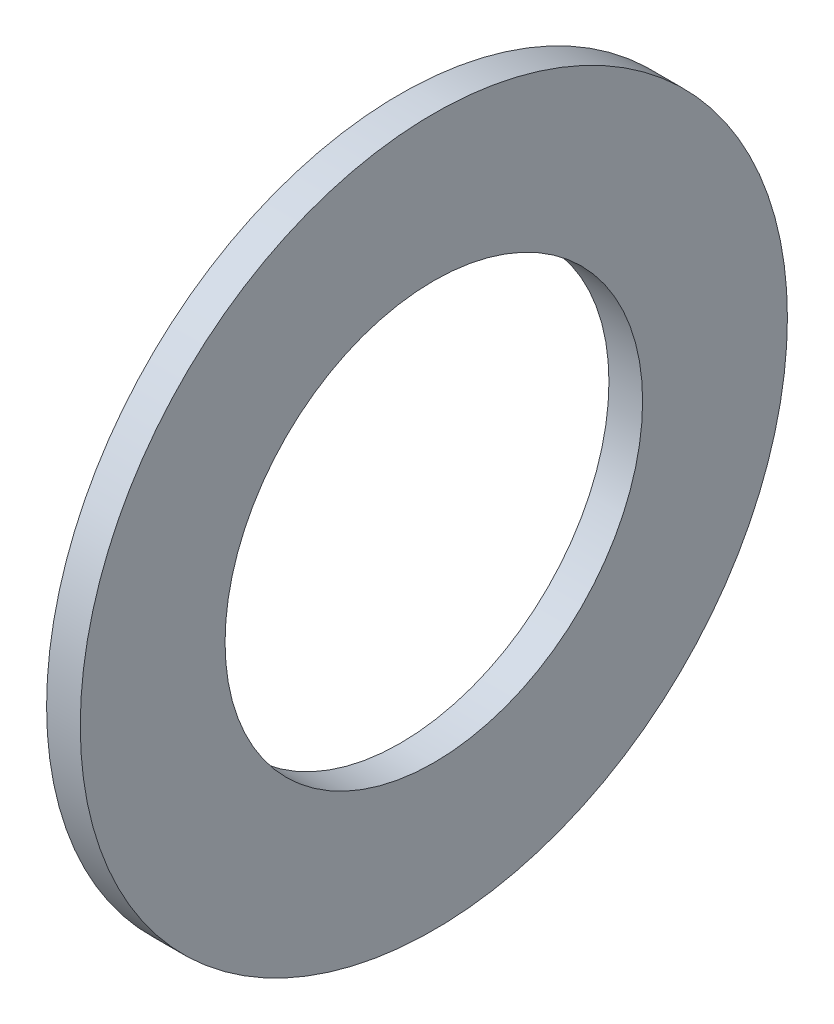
ISO-10303-21;
HEADER;
FILE_DESCRIPTION(('STEP AP214'),'2;1');
FILE_NAME('part.step','',(''),(''),'','','');
FILE_SCHEMA(('AUTOMOTIVE_DESIGN { 1 0 10303 214 1 1 1 1 }'));
ENDSEC;
DATA;
#1=APPLICATION_CONTEXT('core data for automotive mechanical design processes');
#2=APPLICATION_PROTOCOL_DEFINITION('international standard','automotive_design',2000,#1);
#3=PRODUCT_CONTEXT('',#1,'mechanical');
#4=PRODUCT('Part','Part','',(#3));
#5=PRODUCT_RELATED_PRODUCT_CATEGORY('part','',(#4));
#6=PRODUCT_DEFINITION_FORMATION('','',#4);
#7=PRODUCT_DEFINITION_CONTEXT('part definition',#1,'design');
#8=PRODUCT_DEFINITION('design','',#6,#7);
#9=PRODUCT_DEFINITION_SHAPE('','',#8);
#10=(LENGTH_UNIT() NAMED_UNIT(*) SI_UNIT(.MILLI.,.METRE.));
#11=(NAMED_UNIT(*) PLANE_ANGLE_UNIT() SI_UNIT($,.RADIAN.));
#12=(NAMED_UNIT(*) SI_UNIT($,.STERADIAN.) SOLID_ANGLE_UNIT());
#13=UNCERTAINTY_MEASURE_WITH_UNIT(LENGTH_MEASURE(1.E-05),#10,'distance_accuracy_value','');
#14=(GEOMETRIC_REPRESENTATION_CONTEXT(3) GLOBAL_UNCERTAINTY_ASSIGNED_CONTEXT((#13)) GLOBAL_UNIT_ASSIGNED_CONTEXT((#10,
#11,#12)) REPRESENTATION_CONTEXT('',''));
#15=CARTESIAN_POINT('',(0.,0.,0.));
#16=DIRECTION('',(0.,0.,1.));
#17=DIRECTION('',(1.,0.,0.));
#18=AXIS2_PLACEMENT_3D('',#15,#16,#17);
#19=CARTESIAN_POINT('',(1.,0.,0.));
#20=DIRECTION('',(1.,0.,0.));
#21=DIRECTION('',(0.,0.,-1.));
#22=AXIS2_PLACEMENT_3D('',#19,#20,#21);
#23=PLANE('',#22);
#24=CARTESIAN_POINT('',(1.,0.,0.));
#25=DIRECTION('',(1.,0.,0.));
#26=DIRECTION('',(0.,0.,-1.));
#27=AXIS2_PLACEMENT_3D('',#24,#25,#26);
#28=CIRCLE('',#27,6.2);
#29=CARTESIAN_POINT('',(1.,0.,-6.2));
#30=VERTEX_POINT('',#29);
#31=EDGE_CURVE('E26',#30,#30,#28,.F.);
#32=ORIENTED_EDGE('',*,*,#31,.T.);
#33=EDGE_LOOP('',(#32));
#34=FACE_BOUND('',#33,.T.);
#35=CARTESIAN_POINT('',(1.,0.,0.));
#36=DIRECTION('',(1.,0.,0.));
#37=DIRECTION('',(0.,0.,-1.));
#38=AXIS2_PLACEMENT_3D('',#35,#36,#37);
#39=CIRCLE('',#38,10.5);
#40=CARTESIAN_POINT('',(1.,0.,-10.5));
#41=VERTEX_POINT('',#40);
#42=EDGE_CURVE('E17',#41,#41,#39,.F.);
#43=ORIENTED_EDGE('',*,*,#42,.F.);
#44=EDGE_LOOP('',(#43));
#45=FACE_BOUND('',#44,.T.);
#46=ADVANCED_FACE('F14',(#34,#45),#23,.T.);
#47=CARTESIAN_POINT('',(0.5,0.,0.));
#48=DIRECTION('',(1.,0.,0.));
#49=DIRECTION('',(0.,0.,-1.));
#50=AXIS2_PLACEMENT_3D('',#47,#48,#49);
#51=CYLINDRICAL_SURFACE('',#50,10.5);
#52=CARTESIAN_POINT('',(0.,0.,0.));
#53=DIRECTION('',(1.,0.,0.));
#54=DIRECTION('',(0.,0.,-1.));
#55=AXIS2_PLACEMENT_3D('',#52,#53,#54);
#56=CIRCLE('',#55,10.5);
#57=CARTESIAN_POINT('',(0.,0.,-10.5));
#58=VERTEX_POINT('',#57);
#59=EDGE_CURVE('E21',#58,#58,#56,.T.);
#60=ORIENTED_EDGE('',*,*,#59,.T.);
#61=EDGE_LOOP('',(#60));
#62=FACE_BOUND('',#61,.T.);
#63=ORIENTED_EDGE('',*,*,#42,.T.);
#64=EDGE_LOOP('',(#63));
#65=FACE_BOUND('',#64,.T.);
#66=ADVANCED_FACE('F34',(#62,#65),#51,.T.);
#67=CARTESIAN_POINT('',(0.5,0.,0.));
#68=DIRECTION('',(1.,0.,0.));
#69=DIRECTION('',(0.,0.,-1.));
#70=AXIS2_PLACEMENT_3D('',#67,#68,#69);
#71=CYLINDRICAL_SURFACE('',#70,6.2);
#72=CARTESIAN_POINT('',(0.,0.,0.));
#73=DIRECTION('',(1.,0.,0.));
#74=DIRECTION('',(0.,0.,-1.));
#75=AXIS2_PLACEMENT_3D('',#72,#73,#74);
#76=CIRCLE('',#75,6.2);
#77=CARTESIAN_POINT('',(0.,0.,-6.2));
#78=VERTEX_POINT('',#77);
#79=EDGE_CURVE('E10',#78,#78,#76,.F.);
#80=ORIENTED_EDGE('',*,*,#79,.T.);
#81=EDGE_LOOP('',(#80));
#82=FACE_BOUND('',#81,.T.);
#83=ORIENTED_EDGE('',*,*,#31,.F.);
#84=EDGE_LOOP('',(#83));
#85=FACE_BOUND('',#84,.T.);
#86=ADVANCED_FACE('F41',(#82,#85),#71,.F.);
#87=CARTESIAN_POINT('',(0.,0.,0.));
#88=DIRECTION('',(1.,0.,0.));
#89=DIRECTION('',(0.,0.,-1.));
#90=AXIS2_PLACEMENT_3D('',#87,#88,#89);
#91=PLANE('',#90);
#92=ORIENTED_EDGE('',*,*,#79,.F.);
#93=EDGE_LOOP('',(#92));
#94=FACE_BOUND('',#93,.T.);
#95=ORIENTED_EDGE('',*,*,#59,.F.);
#96=EDGE_LOOP('',(#95));
#97=FACE_BOUND('',#96,.T.);
#98=ADVANCED_FACE('F43',(#94,#97),#91,.F.);
#99=CLOSED_SHELL('',(#46,#66,#86,#98));
#100=MANIFOLD_SOLID_BREP('B1',#99);
#101=ADVANCED_BREP_SHAPE_REPRESENTATION('',(#18,#100),#14);
#102=SHAPE_DEFINITION_REPRESENTATION(#9,#101);
ENDSEC;
END-ISO-10303-21;
